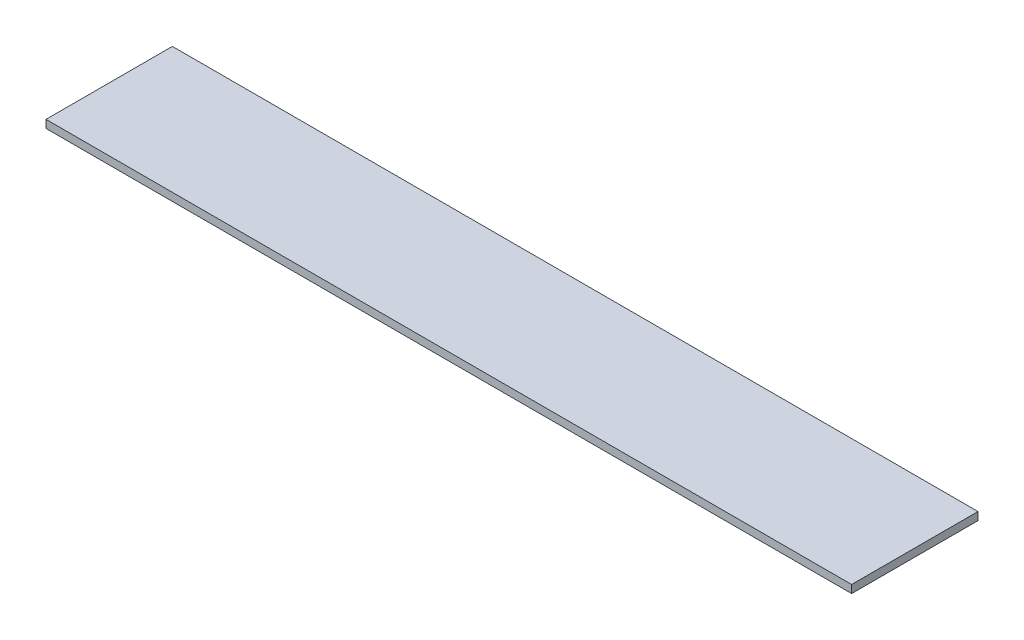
ISO-10303-21;
HEADER;
FILE_DESCRIPTION(('STEP AP214'),'2;1');
FILE_NAME('part.step','',(''),(''),'','','');
FILE_SCHEMA(('AUTOMOTIVE_DESIGN { 1 0 10303 214 1 1 1 1 }'));
ENDSEC;
DATA;
#1=APPLICATION_CONTEXT('core data for automotive mechanical design processes');
#2=APPLICATION_PROTOCOL_DEFINITION('international standard','automotive_design',2000,#1);
#3=PRODUCT_CONTEXT('',#1,'mechanical');
#4=PRODUCT('Part','Part','',(#3));
#5=PRODUCT_RELATED_PRODUCT_CATEGORY('part','',(#4));
#6=PRODUCT_DEFINITION_FORMATION('','',#4);
#7=PRODUCT_DEFINITION_CONTEXT('part definition',#1,'design');
#8=PRODUCT_DEFINITION('design','',#6,#7);
#9=PRODUCT_DEFINITION_SHAPE('','',#8);
#10=(LENGTH_UNIT() NAMED_UNIT(*) SI_UNIT(.MILLI.,.METRE.));
#11=(NAMED_UNIT(*) PLANE_ANGLE_UNIT() SI_UNIT($,.RADIAN.));
#12=(NAMED_UNIT(*) SI_UNIT($,.STERADIAN.) SOLID_ANGLE_UNIT());
#13=UNCERTAINTY_MEASURE_WITH_UNIT(LENGTH_MEASURE(1.E-05),#10,'distance_accuracy_value','');
#14=(GEOMETRIC_REPRESENTATION_CONTEXT(3) GLOBAL_UNCERTAINTY_ASSIGNED_CONTEXT((#13)) GLOBAL_UNIT_ASSIGNED_CONTEXT((#10,
#11,#12)) REPRESENTATION_CONTEXT('',''));
#15=CARTESIAN_POINT('',(0.,0.,0.));
#16=DIRECTION('',(0.,0.,1.));
#17=DIRECTION('',(1.,0.,0.));
#18=AXIS2_PLACEMENT_3D('',#15,#16,#17);
#19=CARTESIAN_POINT('',(323.85,6.35,-50.8));
#20=DIRECTION('',(-1.,0.,0.));
#21=DIRECTION('',(0.,0.,1.));
#22=AXIS2_PLACEMENT_3D('',#19,#20,#21);
#23=PLANE('',#22);
#24=DIRECTION('',(0.,0.,-1.));
#25=VECTOR('',#24,1.);
#26=CARTESIAN_POINT('',(323.85,0.,-50.8));
#27=LINE('',#26,#25);
#28=CARTESIAN_POINT('',(323.85,0.,50.8));
#29=VERTEX_POINT('',#28);
#30=CARTESIAN_POINT('',(323.85,0.,-50.8));
#31=VERTEX_POINT('',#30);
#32=EDGE_CURVE('E97',#29,#31,#27,.T.);
#33=ORIENTED_EDGE('',*,*,#32,.T.);
#34=DIRECTION('',(0.,-1.,0.));
#35=VECTOR('',#34,1.);
#36=CARTESIAN_POINT('',(323.85,6.35,-50.8));
#37=LINE('',#36,#35);
#38=CARTESIAN_POINT('',(323.85,6.35,-50.8));
#39=VERTEX_POINT('',#38);
#40=EDGE_CURVE('E11',#39,#31,#37,.T.);
#41=ORIENTED_EDGE('',*,*,#40,.F.);
#42=DIRECTION('',(0.,0.,-1.));
#43=VECTOR('',#42,1.);
#44=CARTESIAN_POINT('',(323.85,6.35,-50.8));
#45=LINE('',#44,#43);
#46=CARTESIAN_POINT('',(323.85,6.35,50.8));
#47=VERTEX_POINT('',#46);
#48=EDGE_CURVE('E85',#47,#39,#45,.T.);
#49=ORIENTED_EDGE('',*,*,#48,.F.);
#50=DIRECTION('',(0.,-1.,0.));
#51=VECTOR('',#50,1.);
#52=CARTESIAN_POINT('',(323.85,6.35,50.8));
#53=LINE('',#52,#51);
#54=EDGE_CURVE('E93',#47,#29,#53,.T.);
#55=ORIENTED_EDGE('',*,*,#54,.T.);
#56=EDGE_LOOP('',(#33,#41,#49,#55));
#57=FACE_BOUND('',#56,.T.);
#58=ADVANCED_FACE('F34',(#57),#23,.F.);
#59=CARTESIAN_POINT('',(-323.85,6.35,-50.8));
#60=DIRECTION('',(0.,0.,1.));
#61=DIRECTION('',(1.,0.,0.));
#62=AXIS2_PLACEMENT_3D('',#59,#60,#61);
#63=PLANE('',#62);
#64=DIRECTION('',(-1.,0.,0.));
#65=VECTOR('',#64,1.);
#66=CARTESIAN_POINT('',(-323.85,0.,-50.8));
#67=LINE('',#66,#65);
#68=CARTESIAN_POINT('',(-323.85,0.,-50.8));
#69=VERTEX_POINT('',#68);
#70=EDGE_CURVE('E89',#31,#69,#67,.T.);
#71=ORIENTED_EDGE('',*,*,#70,.T.);
#72=DIRECTION('',(0.,-1.,0.));
#73=VECTOR('',#72,1.);
#74=CARTESIAN_POINT('',(-323.85,6.35,-50.8));
#75=LINE('',#74,#73);
#76=CARTESIAN_POINT('',(-323.85,6.35,-50.8));
#77=VERTEX_POINT('',#76);
#78=EDGE_CURVE('E42',#77,#69,#75,.T.);
#79=ORIENTED_EDGE('',*,*,#78,.F.);
#80=DIRECTION('',(-1.,0.,0.));
#81=VECTOR('',#80,1.);
#82=CARTESIAN_POINT('',(-323.85,6.35,-50.8));
#83=LINE('',#82,#81);
#84=EDGE_CURVE('E80',#39,#77,#83,.T.);
#85=ORIENTED_EDGE('',*,*,#84,.F.);
#86=ORIENTED_EDGE('',*,*,#40,.T.);
#87=EDGE_LOOP('',(#71,#79,#85,#86));
#88=FACE_BOUND('',#87,.T.);
#89=ADVANCED_FACE('F88',(#88),#63,.F.);
#90=CARTESIAN_POINT('',(-323.85,6.35,-50.8));
#91=DIRECTION('',(1.,0.,0.));
#92=DIRECTION('',(0.,0.,-1.));
#93=AXIS2_PLACEMENT_3D('',#90,#91,#92);
#94=PLANE('',#93);
#95=DIRECTION('',(0.,0.,1.));
#96=VECTOR('',#95,1.);
#97=CARTESIAN_POINT('',(-323.85,0.,-50.8));
#98=LINE('',#97,#96);
#99=CARTESIAN_POINT('',(-323.85,0.,50.8));
#100=VERTEX_POINT('',#99);
#101=EDGE_CURVE('E67',#69,#100,#98,.T.);
#102=ORIENTED_EDGE('',*,*,#101,.T.);
#103=DIRECTION('',(0.,-1.,0.));
#104=VECTOR('',#103,1.);
#105=CARTESIAN_POINT('',(-323.85,6.35,50.8));
#106=LINE('',#105,#104);
#107=CARTESIAN_POINT('',(-323.85,6.35,50.8));
#108=VERTEX_POINT('',#107);
#109=EDGE_CURVE('E90',#108,#100,#106,.T.);
#110=ORIENTED_EDGE('',*,*,#109,.F.);
#111=DIRECTION('',(0.,0.,1.));
#112=VECTOR('',#111,1.);
#113=CARTESIAN_POINT('',(-323.85,6.35,-50.8));
#114=LINE('',#113,#112);
#115=EDGE_CURVE('E83',#77,#108,#114,.T.);
#116=ORIENTED_EDGE('',*,*,#115,.F.);
#117=ORIENTED_EDGE('',*,*,#78,.T.);
#118=EDGE_LOOP('',(#102,#110,#116,#117));
#119=FACE_BOUND('',#118,.T.);
#120=ADVANCED_FACE('F91',(#119),#94,.F.);
#121=CARTESIAN_POINT('',(-323.85,6.35,50.8));
#122=DIRECTION('',(0.,0.,-1.));
#123=DIRECTION('',(-1.,0.,0.));
#124=AXIS2_PLACEMENT_3D('',#121,#122,#123);
#125=PLANE('',#124);
#126=DIRECTION('',(1.,0.,0.));
#127=VECTOR('',#126,1.);
#128=CARTESIAN_POINT('',(-323.85,0.,50.8));
#129=LINE('',#128,#127);
#130=EDGE_CURVE('E73',#100,#29,#129,.T.);
#131=ORIENTED_EDGE('',*,*,#130,.T.);
#132=ORIENTED_EDGE('',*,*,#54,.F.);
#133=DIRECTION('',(1.,0.,0.));
#134=VECTOR('',#133,1.);
#135=CARTESIAN_POINT('',(-323.85,6.35,50.8));
#136=LINE('',#135,#134);
#137=EDGE_CURVE('E50',#108,#47,#136,.T.);
#138=ORIENTED_EDGE('',*,*,#137,.F.);
#139=ORIENTED_EDGE('',*,*,#109,.T.);
#140=EDGE_LOOP('',(#131,#132,#138,#139));
#141=FACE_BOUND('',#140,.T.);
#142=ADVANCED_FACE('F104',(#141),#125,.F.);
#143=CARTESIAN_POINT('',(323.85,6.35,50.8));
#144=DIRECTION('',(0.,1.,0.));
#145=DIRECTION('',(0.,0.,1.));
#146=AXIS2_PLACEMENT_3D('',#143,#144,#145);
#147=PLANE('',#146);
#148=ORIENTED_EDGE('',*,*,#48,.T.);
#149=ORIENTED_EDGE('',*,*,#84,.T.);
#150=ORIENTED_EDGE('',*,*,#115,.T.);
#151=ORIENTED_EDGE('',*,*,#137,.T.);
#152=EDGE_LOOP('',(#148,#149,#150,#151));
#153=FACE_BOUND('',#152,.T.);
#154=ADVANCED_FACE('F81',(#153),#147,.T.);
#155=CARTESIAN_POINT('',(323.85,0.,50.8));
#156=DIRECTION('',(0.,1.,0.));
#157=DIRECTION('',(0.,0.,1.));
#158=AXIS2_PLACEMENT_3D('',#155,#156,#157);
#159=PLANE('',#158);
#160=ORIENTED_EDGE('',*,*,#32,.F.);
#161=ORIENTED_EDGE('',*,*,#130,.F.);
#162=ORIENTED_EDGE('',*,*,#101,.F.);
#163=ORIENTED_EDGE('',*,*,#70,.F.);
#164=EDGE_LOOP('',(#160,#161,#162,#163));
#165=FACE_BOUND('',#164,.T.);
#166=ADVANCED_FACE('F107',(#165),#159,.F.);
#167=CLOSED_SHELL('',(#58,#89,#120,#142,#154,#166));
#168=MANIFOLD_SOLID_BREP('B2',#167);
#169=ADVANCED_BREP_SHAPE_REPRESENTATION('',(#18,#168),#14);
#170=SHAPE_DEFINITION_REPRESENTATION(#9,#169);
ENDSEC;
END-ISO-10303-21;
